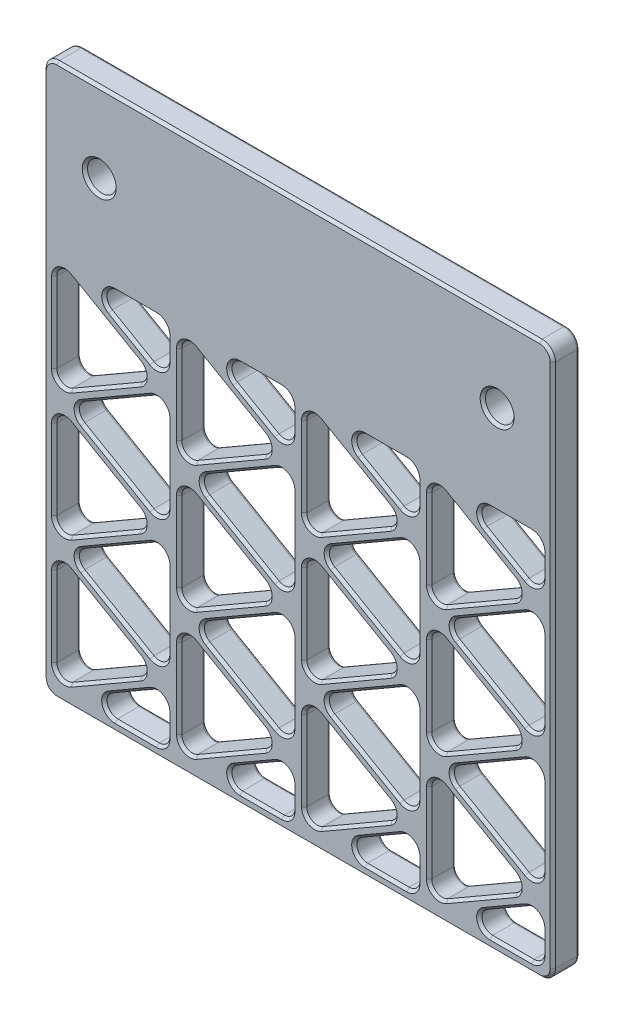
from build123d import *

# Parameters (mm, degrees)
SZKIC1_W                    = 96
SZKIC1_H                    = 104
DODANIE_WYCI_GNI_CIE1_DEPTH = 5
SZKIC3_R                    = 2.7
WYTNIJ_WYCI_GNI_CIE1_DEPTH  = 142.622738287
ZAOKR_GLENIE1_R             = 2.5
ZAOKR_GLENIE2_R             = 2
ZAOKR_GLENIE3_R             = 2
ZAOKR_GLENIE4_R             = 2
ZAOKR_GLENIE5_R             = 2
ZAOKR_GLENIE6_R             = 0.5
SFAZOWANIE1_SIZE            = 0.5


with BuildPart() as part:
    # Szkic1 → Dodanie-wyci_gni_cie1 (new body)
    with BuildSketch(Plane.XY):
        with Locations((48, 52)):
            Rectangle(SZKIC1_W, SZKIC1_H)
    extrude(amount=DODANIE_WYCI_GNI_CIE1_DEPTH)

    # Szkic3 → Wytnij-wyci_gni_cie1 (cut, through all)
    with BuildSketch(Plane.XY.offset(5)):
        with Locations((10.5, 89)):
            Circle(SZKIC3_R)
        with Locations((85.5, 89)):
            Circle(SZKIC3_R)
        Polygon((2, 72), (2, 50), (21.052558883, 61), align=None)
        Polygon((21.052558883, 37), (2, 26), (2, 48), align=None)
        Polygon((2, 24), (2, 2), (21.052558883, 13), align=None)
        Polygon((6, 72), (23.320508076, 62), (23.320508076, 72), align=None)
        Polygon((23.320508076, 60), (4.267949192, 49), (23.320508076, 38), align=None)
        Polygon((23.320508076, 14), (4.267949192, 25), (23.320508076, 36), align=None)
        Polygon((6, 2), (23.320508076, 12), (23.320508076, 2), align=None)
        Polygon((25.559830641, 72), (25.559830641, 50), (44.612389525, 61), align=None)
        Polygon((44.612389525, 37), (25.559830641, 26), (25.559830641, 48), align=None)
        Polygon((25.559830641, 24), (25.559830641, 2), (44.612389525, 13), align=None)
        Polygon((29.559830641, 72), (46.880338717, 62), (46.880338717, 72), align=None)
        Polygon((46.880338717, 60), (27.827779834, 49), (46.880338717, 38), align=None)
        Polygon((46.880338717, 14), (27.827779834, 25), (46.880338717, 36), align=None)
        Polygon((29.559830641, 2), (46.880338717, 12), (46.880338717, 2), align=None)
        Polygon((49.119661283, 72), (49.119661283, 50), (68.172220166, 61), align=None)
        Polygon((68.172220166, 37), (49.119661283, 26), (49.119661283, 48), align=None)
        Polygon((49.119661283, 24), (49.119661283, 2), (68.172220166, 13), align=None)
        Polygon((53.119661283, 72), (70.440169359, 62), (70.440169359, 72), align=None)
        Polygon((70.440169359, 60), (51.387610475, 49), (70.440169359, 38), align=None)
        Polygon((70.440169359, 14), (51.387610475, 25), (70.440169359, 36), align=None)
        Polygon((53.119661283, 2), (70.440169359, 12), (70.440169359, 2), align=None)
        Polygon((72.679491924, 72), (72.679491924, 50), (91.732050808, 61), align=None)
        Polygon((91.732050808, 37), (72.679491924, 26), (72.679491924, 48), align=None)
        Polygon((72.679491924, 24), (72.679491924, 2), (91.732050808, 13), align=None)
        Polygon((76.679491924, 72), (94, 62), (94, 72), align=None)
        Polygon((94, 60), (74.947441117, 49), (94, 38), align=None)
        Polygon((94, 14), (74.947441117, 25), (94, 36), align=None)
        Polygon((76.679491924, 2), (94, 12), (94, 2), align=None)
    extrude(amount=-WYTNIJ_WYCI_GNI_CIE1_DEPTH, mode=Mode.SUBTRACT)

    # Zaokr_glenie1
    zaokr_glenie1_edges = [part.edges().sort_by_distance(p)[0] for p in [
        (0, 104, 2.5),
        (96, 104, 2.5),
        (96, 0, 2.5),
        (0, 0, 2.5),
    ]]
    fillet(zaokr_glenie1_edges, radius=ZAOKR_GLENIE1_R)

    # Zaokr_glenie2
    zaokr_glenie2_edges = [part.edges().sort_by_distance(p)[0] for p in [
        (46.880338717, 72, 2.5),
        (46.880338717, 12, 2.5),
        (46.880338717, 60, 2.5),
        (46.880338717, 36, 2.5),
        (23.320508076, 12, 2.5),
        (23.320508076, 60, 2.5),
        (23.320508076, 36, 2.5),
        (23.320508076, 72, 2.5),
        (94, 60, 2.5),
        (94, 36, 2.5),
        (94, 72, 2.5),
        (94, 12, 2.5),
        (70.440169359, 36, 2.5),
        (70.440169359, 72, 2.5),
        (70.440169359, 60, 2.5),
        (70.440169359, 12, 2.5),
    ]]
    fillet(zaokr_glenie2_edges, radius=ZAOKR_GLENIE2_R)

    # Zaokr_glenie3
    zaokr_glenie3_edges = [part.edges().sort_by_distance(p)[0] for p in [
        (29.559830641, 72, 2.5),
        (29.559830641, 2, 2.5),
        (27.827779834, 49, 2.5),
        (27.827779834, 25, 2.5),
        (6, 2, 2.5),
        (4.267949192, 49, 2.5),
        (4.267949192, 25, 2.5),
        (6, 72, 2.5),
        (74.947441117, 49, 2.5),
        (74.947441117, 25, 2.5),
        (76.679491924, 72, 2.5),
        (76.679491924, 2, 2.5),
        (51.387610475, 25, 2.5),
        (53.119661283, 72, 2.5),
        (51.387610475, 49, 2.5),
        (53.119661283, 2, 2.5),
    ]]
    fillet(zaokr_glenie3_edges, radius=ZAOKR_GLENIE3_R)

    # Zaokr_glenie4
    zaokr_glenie4_edges = [part.edges().sort_by_distance(p)[0] for p in [
        (25.559830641, 24, 2.5),
        (25.559830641, 2, 2.5),
        (25.559830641, 48, 2.5),
        (25.559830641, 72, 2.5),
        (25.559830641, 50, 2.5),
        (49.119661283, 72, 2.5),
        (49.119661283, 50, 2.5),
        (2, 72, 2.5),
        (2, 50, 2.5),
        (2, 48, 2.5),
        (2, 26, 2.5),
        (2, 24, 2.5),
        (2, 2, 2.5),
        (72.679491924, 24, 2.5),
        (72.679491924, 2, 2.5),
        (49.119661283, 24, 2.5),
        (49.119661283, 2, 2.5),
        (49.119661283, 48, 2.5),
        (49.119661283, 26, 2.5),
        (72.679491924, 72, 2.5),
        (72.679491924, 50, 2.5),
        (72.679491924, 48, 2.5),
        (72.679491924, 26, 2.5),
    ]]
    fillet(zaokr_glenie4_edges, radius=ZAOKR_GLENIE4_R)

    # Zaokr_glenie5
    zaokr_glenie5_edges = [part.edges().sort_by_distance(p)[0] for p in [
        (46.880338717, 62, 2.5),
        (44.612389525, 13, 2.5),
        (44.612389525, 37, 2.5),
        (25.559830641, 26, 2.5),
        (44.612389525, 61, 2.5),
        (68.172220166, 61, 2.5),
        (46.880338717, 2, 2.5),
        (46.880338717, 38, 2.5),
        (46.880338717, 14, 2.5),
        (21.052558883, 61, 2.5),
        (21.052558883, 37, 2.5),
        (21.052558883, 13, 2.5),
        (23.320508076, 2, 2.5),
        (23.320508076, 38, 2.5),
        (23.320508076, 14, 2.5),
        (23.320508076, 62, 2.5),
        (94, 38, 2.5),
        (94, 14, 2.5),
        (94, 62, 2.5),
        (91.732050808, 13, 2.5),
        (94, 2, 2.5),
        (70.440169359, 14, 2.5),
        (70.440169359, 62, 2.5),
        (68.172220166, 13, 2.5),
        (68.172220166, 37, 2.5),
        (70.440169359, 38, 2.5),
        (70.440169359, 2, 2.5),
        (91.732050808, 61, 2.5),
        (91.732050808, 37, 2.5),
    ]]
    fillet(zaokr_glenie5_edges, radius=ZAOKR_GLENIE5_R)

    # Zaokr_glenie6
    zaokr_glenie6_edges = [part.edges().sort_by_distance(p)[0] for p in [
        (82.8, 89, 0),
        (7.8, 89, 0),
        (48, 0, 0),
        (0, 52, 0),
        (48, 104, 0),
        (96, 52, 0),
        (0.732233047, 103.267766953, 0),
        (95.267766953, 103.267766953, 0),
        (95.267766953, 0.732233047, 0),
        (0.732233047, 0.732233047, 0),
        (16.392304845, 8, 0),
        (39.952135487, 8, 0),
        (63.511966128, 8, 0),
        (87.07179677, 8, 0),
        (84.473720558, 30.5, 0),
        (60.913889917, 30.5, 0),
        (37.354059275, 30.5, 0),
        (13.794228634, 30.5, 0),
        (13.794228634, 54.5, 0),
        (37.354059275, 54.5, 0),
        (60.913889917, 54.5, 0),
        (84.473720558, 54.5, 0),
        (88.07179677, 72, 0),
        (64.511966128, 72, 0),
        (40.952135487, 72, 0),
        (17.392304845, 72, 0),
        (22.320508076, 10.267949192, 0),
        (45.880338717, 10.267949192, 0),
        (69.440169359, 10.267949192, 0),
        (93, 10.267949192, 0),
        (93, 34.267949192, 0),
        (69.440169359, 34.267949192, 0),
        (45.880338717, 34.267949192, 0),
        (22.320508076, 34.267949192, 0),
        (22.320508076, 58.267949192, 0),
        (45.880338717, 58.267949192, 0),
        (69.440169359, 58.267949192, 0),
        (93, 58.267949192, 0),
        (93.414213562, 71.414213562, 0),
        (69.854382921, 71.414213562, 0),
        (46.294552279, 71.414213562, 0),
        (22.734721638, 71.414213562, 0),
        (88.07179677, 2, 0),
        (64.511966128, 2, 0),
        (40.952135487, 2, 0),
        (17.392304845, 2, 0),
        (13.794228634, 43.5, 0),
        (60.913889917, 43.5, 0),
        (84.473720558, 19.5, 0),
        (60.913889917, 19.5, 0),
        (37.354059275, 19.5, 0),
        (13.794228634, 19.5, 0),
        (37.354059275, 43.5, 0),
        (84.473720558, 43.5, 0),
        (87.07179677, 66, 0),
        (63.511966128, 66, 0),
        (39.952135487, 66, 0),
        (16.392304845, 66, 0),
        (82.211741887, 3.48236191, 0),
        (58.651911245, 3.48236191, 0),
        (35.092080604, 3.48236191, 0),
        (11.532249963, 3.48236191, 0),
        (6.267949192, 49, 0),
        (53.387610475, 49, 0),
        (76.947441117, 25, 0),
        (53.387610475, 25, 0),
        (29.827779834, 25, 0),
        (6.267949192, 25, 0),
        (29.827779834, 49, 0),
        (76.947441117, 49, 0),
        (82.211741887, 70.51763809, 0),
        (58.651911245, 70.51763809, 0),
        (35.092080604, 70.51763809, 0),
        (11.532249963, 70.51763809, 0),
        (58.645940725, 7.5, 0),
        (49.119661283, 13, 0),
        (82.205771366, 7.5, 0),
        (72.679491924, 13, 0),
        (82.205771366, 31.5, 0),
        (72.679491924, 37, 0),
        (82.205771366, 55.5, 0),
        (72.679491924, 61, 0),
        (58.645940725, 31.5, 0),
        (49.119661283, 37, 0),
        (35.086110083, 7.5, 0),
        (25.559830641, 13, 0),
        (11.526279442, 7.5, 0),
        (2, 13, 0),
        (58.645940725, 55.5, 0),
        (49.119661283, 61, 0),
        (35.086110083, 55.5, 0),
        (25.559830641, 61, 0),
        (11.526279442, 55.5, 0),
        (2, 61, 0),
        (11.526279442, 31.5, 0),
        (2, 37, 0),
        (25.559830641, 37, 0),
        (50.119661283, 3.732050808, 0),
        (73.679491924, 3.732050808, 0),
        (73.679491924, 27.732050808, 0),
        (73.679491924, 51.732050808, 0),
        (50.119661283, 27.732050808, 0),
        (26.559830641, 3.732050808, 0),
        (3, 3.732050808, 0),
        (50.119661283, 51.732050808, 0),
        (26.559830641, 51.732050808, 0),
        (3, 51.732050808, 0),
        (3, 27.732050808, 0),
        (73.679491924, 22.267949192, 0),
        (50.119661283, 22.267949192, 0),
        (26.559830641, 22.267949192, 0),
        (3, 22.267949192, 0),
        (3, 46.267949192, 0),
        (26.559830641, 46.267949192, 0),
        (50.119661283, 46.267949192, 0),
        (73.679491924, 46.267949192, 0),
        (73.679491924, 70.267949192, 0),
        (50.119661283, 70.267949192, 0),
        (26.559830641, 70.267949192, 0),
        (3, 70.267949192, 0),
        (35.086110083, 31.5, 0),
        (82.205771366, 66.5, 0),
        (58.645940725, 66.5, 0),
        (35.086110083, 66.5, 0),
        (11.526279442, 66.5, 0),
        (82.205771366, 42.5, 0),
        (58.645940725, 42.5, 0),
        (11.526279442, 42.5, 0),
        (35.086110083, 42.5, 0),
        (11.526279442, 18.5, 0),
        (35.086110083, 18.5, 0),
        (58.645940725, 18.5, 0),
        (23.320508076, 6.267949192, 0),
        (23.320508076, 25, 0),
        (23.320508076, 49, 0),
        (23.320508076, 67.732050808, 0),
        (46.880338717, 67.732050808, 0),
        (70.440169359, 67.732050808, 0),
        (46.880338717, 6.267949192, 0),
        (46.880338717, 49, 0),
        (94, 6.267949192, 0),
        (70.440169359, 6.267949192, 0),
        (70.440169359, 25, 0),
        (46.880338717, 25, 0),
        (70.440169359, 49, 0),
        (94, 67.732050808, 0),
        (94, 49, 0),
        (94, 25, 0),
        (82.205771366, 18.5, 0),
        (26.559830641, 27.732050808, 0),
        (89.732050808, 61, 0),
        (66.172220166, 61, 0),
        (42.612389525, 61, 0),
        (19.052558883, 61, 0),
        (89.732050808, 37, 0),
        (66.172220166, 37, 0),
        (19.052558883, 37, 0),
        (42.612389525, 37, 0),
        (19.052558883, 13, 0),
        (42.612389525, 13, 0),
        (66.172220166, 13, 0),
        (22.734721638, 2.585786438, 0),
        (22.320508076, 15.732050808, 0),
        (22.320508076, 39.732050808, 0),
        (22.320508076, 63.732050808, 0),
        (45.880338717, 63.732050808, 0),
        (69.440169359, 63.732050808, 0),
        (46.294552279, 2.585786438, 0),
        (45.880338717, 39.732050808, 0),
        (93.414213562, 2.585786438, 0),
        (69.854382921, 2.585786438, 0),
        (69.440169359, 15.732050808, 0),
        (45.880338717, 15.732050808, 0),
        (69.440169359, 39.732050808, 0),
        (93, 63.732050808, 0),
        (93, 39.732050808, 0),
        (93, 15.732050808, 0),
        (89.732050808, 13, 0),
    ]]
    fillet(zaokr_glenie6_edges, radius=ZAOKR_GLENIE6_R)

    # Sfazowanie1
    sfazowanie1_edges = [part.edges().sort_by_distance(p)[0] for p in [
        (82.8, 89, 5),
        (7.8, 89, 5),
        (48, 0, 5),
        (0, 52, 5),
        (96, 52, 5),
        (48, 104, 5),
        (0.732233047, 103.267766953, 5),
        (95.267766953, 103.267766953, 5),
        (95.267766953, 0.732233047, 5),
        (0.732233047, 0.732233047, 5),
        (16.392304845, 8, 5),
        (39.952135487, 8, 5),
        (63.511966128, 8, 5),
        (87.07179677, 8, 5),
        (84.473720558, 30.5, 5),
        (60.913889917, 30.5, 5),
        (37.354059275, 30.5, 5),
        (13.794228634, 30.5, 5),
        (13.794228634, 54.5, 5),
        (37.354059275, 54.5, 5),
        (60.913889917, 54.5, 5),
        (84.473720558, 54.5, 5),
        (88.07179677, 72, 5),
        (64.511966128, 72, 5),
        (40.952135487, 72, 5),
        (17.392304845, 72, 5),
        (22.320508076, 10.267949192, 5),
        (45.880338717, 10.267949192, 5),
        (69.440169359, 10.267949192, 5),
        (93, 10.267949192, 5),
        (93, 34.267949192, 5),
        (69.440169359, 34.267949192, 5),
        (45.880338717, 34.267949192, 5),
        (22.320508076, 34.267949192, 5),
        (22.320508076, 58.267949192, 5),
        (45.880338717, 58.267949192, 5),
        (69.440169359, 58.267949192, 5),
        (93, 58.267949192, 5),
        (93.414213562, 71.414213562, 5),
        (69.854382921, 71.414213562, 5),
        (46.294552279, 71.414213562, 5),
        (22.734721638, 71.414213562, 5),
        (88.07179677, 2, 5),
        (64.511966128, 2, 5),
        (40.952135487, 2, 5),
        (17.392304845, 2, 5),
        (13.794228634, 43.5, 5),
        (60.913889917, 43.5, 5),
        (84.473720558, 19.5, 5),
        (60.913889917, 19.5, 5),
        (37.354059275, 19.5, 5),
        (13.794228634, 19.5, 5),
        (37.354059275, 43.5, 5),
        (84.473720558, 43.5, 5),
        (87.07179677, 66, 5),
        (63.511966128, 66, 5),
        (39.952135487, 66, 5),
        (16.392304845, 66, 5),
        (82.211741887, 3.48236191, 5),
        (58.651911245, 3.48236191, 5),
        (35.092080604, 3.48236191, 5),
        (11.532249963, 3.48236191, 5),
        (6.267949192, 49, 5),
        (53.387610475, 49, 5),
        (76.947441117, 25, 5),
        (53.387610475, 25, 5),
        (29.827779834, 25, 5),
        (6.267949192, 25, 5),
        (29.827779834, 49, 5),
        (76.947441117, 49, 5),
        (82.211741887, 70.51763809, 5),
        (58.651911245, 70.51763809, 5),
        (35.092080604, 70.51763809, 5),
        (11.532249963, 70.51763809, 5),
        (58.645940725, 7.5, 5),
        (49.119661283, 13, 5),
        (82.205771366, 7.5, 5),
        (72.679491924, 13, 5),
        (82.205771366, 31.5, 5),
        (72.679491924, 37, 5),
        (82.205771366, 55.5, 5),
        (72.679491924, 61, 5),
        (58.645940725, 31.5, 5),
        (49.119661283, 37, 5),
        (35.086110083, 7.5, 5),
        (25.559830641, 13, 5),
        (11.526279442, 7.5, 5),
        (2, 13, 5),
        (58.645940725, 55.5, 5),
        (49.119661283, 61, 5),
        (35.086110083, 55.5, 5),
        (25.559830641, 61, 5),
        (11.526279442, 55.5, 5),
        (2, 61, 5),
        (11.526279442, 31.5, 5),
        (2, 37, 5),
        (25.559830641, 37, 5),
        (50.119661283, 3.732050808, 5),
        (73.679491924, 3.732050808, 5),
        (73.679491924, 27.732050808, 5),
        (73.679491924, 51.732050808, 5),
        (50.119661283, 27.732050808, 5),
        (26.559830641, 3.732050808, 5),
        (3, 3.732050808, 5),
        (50.119661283, 51.732050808, 5),
        (26.559830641, 51.732050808, 5),
        (3, 51.732050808, 5),
        (3, 27.732050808, 5),
        (73.679491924, 22.267949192, 5),
        (50.119661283, 22.267949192, 5),
        (26.559830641, 22.267949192, 5),
        (3, 22.267949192, 5),
        (3, 46.267949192, 5),
        (26.559830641, 46.267949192, 5),
        (50.119661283, 46.267949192, 5),
        (73.679491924, 46.267949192, 5),
        (73.679491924, 70.267949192, 5),
        (50.119661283, 70.267949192, 5),
        (26.559830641, 70.267949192, 5),
        (3, 70.267949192, 5),
        (35.086110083, 31.5, 5),
        (82.205771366, 66.5, 5),
        (58.645940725, 66.5, 5),
        (35.086110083, 66.5, 5),
        (11.526279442, 66.5, 5),
        (82.205771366, 42.5, 5),
        (58.645940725, 42.5, 5),
        (11.526279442, 42.5, 5),
        (35.086110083, 42.5, 5),
        (11.526279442, 18.5, 5),
        (35.086110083, 18.5, 5),
        (58.645940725, 18.5, 5),
        (23.320508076, 6.267949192, 5),
        (23.320508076, 25, 5),
        (23.320508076, 49, 5),
        (23.320508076, 67.732050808, 5),
        (46.880338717, 67.732050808, 5),
        (70.440169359, 67.732050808, 5),
        (46.880338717, 6.267949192, 5),
        (46.880338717, 49, 5),
        (94, 6.267949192, 5),
        (70.440169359, 6.267949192, 5),
        (70.440169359, 25, 5),
        (46.880338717, 25, 5),
        (70.440169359, 49, 5),
        (94, 67.732050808, 5),
        (94, 49, 5),
        (94, 25, 5),
        (82.205771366, 18.5, 5),
        (26.559830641, 27.732050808, 5),
        (89.732050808, 61, 5),
        (66.172220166, 61, 5),
        (42.612389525, 61, 5),
        (19.052558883, 61, 5),
        (89.732050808, 37, 5),
        (66.172220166, 37, 5),
        (19.052558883, 37, 5),
        (42.612389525, 37, 5),
        (19.052558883, 13, 5),
        (42.612389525, 13, 5),
        (66.172220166, 13, 5),
        (22.734721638, 2.585786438, 5),
        (22.320508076, 15.732050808, 5),
        (22.320508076, 39.732050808, 5),
        (22.320508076, 63.732050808, 5),
        (45.880338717, 63.732050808, 5),
        (69.440169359, 63.732050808, 5),
        (46.294552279, 2.585786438, 5),
        (45.880338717, 39.732050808, 5),
        (93.414213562, 2.585786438, 5),
        (69.854382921, 2.585786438, 5),
        (69.440169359, 15.732050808, 5),
        (45.880338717, 15.732050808, 5),
        (69.440169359, 39.732050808, 5),
        (93, 63.732050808, 5),
        (93, 39.732050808, 5),
        (93, 15.732050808, 5),
        (89.732050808, 13, 5),
    ]]
    chamfer(sfazowanie1_edges, length=SFAZOWANIE1_SIZE)


solid = part.part
